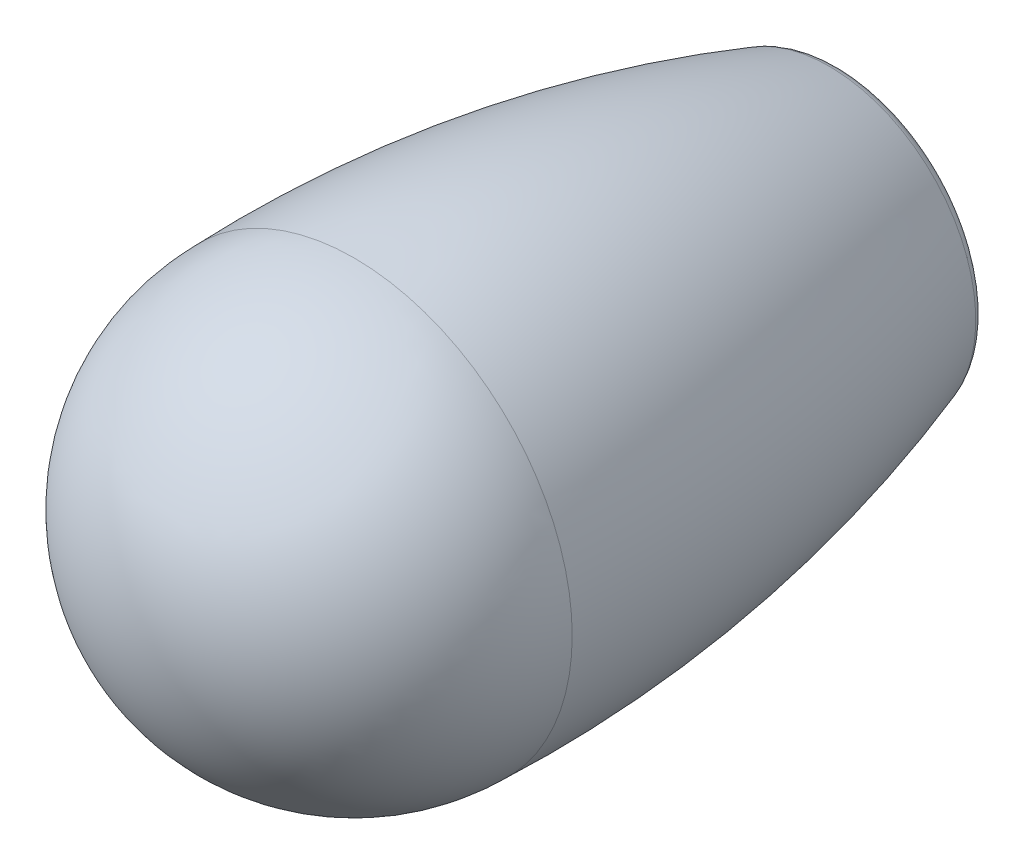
ISO-10303-21;
HEADER;
FILE_DESCRIPTION(('STEP AP214'),'2;1');
FILE_NAME('part.step','',(''),(''),'','','');
FILE_SCHEMA(('AUTOMOTIVE_DESIGN { 1 0 10303 214 1 1 1 1 }'));
ENDSEC;
DATA;
#1=APPLICATION_CONTEXT('core data for automotive mechanical design processes');
#2=APPLICATION_PROTOCOL_DEFINITION('international standard','automotive_design',2000,#1);
#3=PRODUCT_CONTEXT('',#1,'mechanical');
#4=PRODUCT('Part','Part','',(#3));
#5=PRODUCT_RELATED_PRODUCT_CATEGORY('part','',(#4));
#6=PRODUCT_DEFINITION_FORMATION('','',#4);
#7=PRODUCT_DEFINITION_CONTEXT('part definition',#1,'design');
#8=PRODUCT_DEFINITION('design','',#6,#7);
#9=PRODUCT_DEFINITION_SHAPE('','',#8);
#10=(LENGTH_UNIT() NAMED_UNIT(*) SI_UNIT(.MILLI.,.METRE.));
#11=(NAMED_UNIT(*) PLANE_ANGLE_UNIT() SI_UNIT($,.RADIAN.));
#12=(NAMED_UNIT(*) SI_UNIT($,.STERADIAN.) SOLID_ANGLE_UNIT());
#13=UNCERTAINTY_MEASURE_WITH_UNIT(LENGTH_MEASURE(1.E-05),#10,'distance_accuracy_value','');
#14=(GEOMETRIC_REPRESENTATION_CONTEXT(3) GLOBAL_UNCERTAINTY_ASSIGNED_CONTEXT((#13)) GLOBAL_UNIT_ASSIGNED_CONTEXT((#10,
#11,#12)) REPRESENTATION_CONTEXT('',''));
#15=CARTESIAN_POINT('',(0.,0.,0.));
#16=DIRECTION('',(0.,0.,1.));
#17=DIRECTION('',(1.,0.,0.));
#18=AXIS2_PLACEMENT_3D('',#15,#16,#17);
#19=CARTESIAN_POINT('',(0.,0.,1.));
#20=DIRECTION('',(0.,0.,-1.));
#21=DIRECTION('',(-1.,0.,0.));
#22=AXIS2_PLACEMENT_3D('',#19,#20,#21);
#23=TOROIDAL_SURFACE('',#22,7.78846659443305,1.);
#24=CARTESIAN_POINT('',(0.,0.,0.));
#25=DIRECTION('',(0.,0.,-1.));
#26=DIRECTION('',(-1.,0.,0.));
#27=AXIS2_PLACEMENT_3D('',#24,#25,#26);
#28=CIRCLE('',#27,7.78846659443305);
#29=CARTESIAN_POINT('',(-7.78846659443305,0.,0.));
#30=VERTEX_POINT('',#29);
#31=EDGE_CURVE('E8',#30,#30,#28,.T.);
#32=ORIENTED_EDGE('',*,*,#31,.F.);
#33=EDGE_LOOP('',(#32));
#34=FACE_BOUND('',#33,.T.);
#35=CARTESIAN_POINT('',(0.,0.,0.676469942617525));
#36=DIRECTION('',(0.,0.,-1.));
#37=DIRECTION('',(-1.,0.,0.));
#38=AXIS2_PLACEMENT_3D('',#35,#36,#37);
#39=CIRCLE('',#38,8.73468448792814);
#40=CARTESIAN_POINT('',(-8.73468448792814,0.,0.676469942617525));
#41=VERTEX_POINT('',#40);
#42=EDGE_CURVE('E37',#41,#41,#39,.T.);
#43=ORIENTED_EDGE('',*,*,#42,.T.);
#44=EDGE_LOOP('',(#43));
#45=FACE_BOUND('',#44,.T.);
#46=ADVANCED_FACE('F12',(#34,#45),#23,.T.);
#47=CARTESIAN_POINT('',(0.,7.788466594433,0.));
#48=DIRECTION('',(0.,0.,1.));
#49=DIRECTION('',(1.,0.,0.));
#50=AXIS2_PLACEMENT_3D('',#47,#48,#49);
#51=PLANE('',#50);
#52=CARTESIAN_POINT('',(0.,0.,0.));
#53=DIRECTION('',(0.,0.,-1.));
#54=DIRECTION('',(-1.,0.,0.));
#55=AXIS2_PLACEMENT_3D('',#52,#53,#54);
#56=CIRCLE('',#55,5.5);
#57=CARTESIAN_POINT('',(-5.5,0.,0.));
#58=VERTEX_POINT('',#57);
#59=EDGE_CURVE('E18',#58,#58,#56,.T.);
#60=ORIENTED_EDGE('',*,*,#59,.F.);
#61=EDGE_LOOP('',(#60));
#62=FACE_BOUND('',#61,.T.);
#63=ORIENTED_EDGE('',*,*,#31,.T.);
#64=EDGE_LOOP('',(#63));
#65=FACE_BOUND('',#64,.T.);
#66=ADVANCED_FACE('F61',(#62,#65),#51,.F.);
#67=CARTESIAN_POINT('',(0.,0.,-7.06669541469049));
#68=DIRECTION('',(0.,0.,-1.));
#69=DIRECTION('',(-1.,0.,0.));
#70=AXIS2_PLACEMENT_3D('',#67,#68,#69);
#71=CYLINDRICAL_SURFACE('',#70,5.5);
#72=CARTESIAN_POINT('',(0.,0.,11.));
#73=DIRECTION('',(0.,0.,-1.));
#74=DIRECTION('',(-1.,0.,0.));
#75=AXIS2_PLACEMENT_3D('',#72,#73,#74);
#76=CIRCLE('',#75,5.5);
#77=CARTESIAN_POINT('',(-5.5,0.,11.));
#78=VERTEX_POINT('',#77);
#79=EDGE_CURVE('E22',#78,#78,#76,.T.);
#80=ORIENTED_EDGE('',*,*,#79,.F.);
#81=EDGE_LOOP('',(#80));
#82=FACE_BOUND('',#81,.T.);
#83=ORIENTED_EDGE('',*,*,#59,.T.);
#84=EDGE_LOOP('',(#83));
#85=FACE_BOUND('',#84,.T.);
#86=ADVANCED_FACE('F67',(#82,#85),#71,.F.);
#87=CARTESIAN_POINT('',(0.,5.5,11.));
#88=DIRECTION('',(0.,0.,1.));
#89=DIRECTION('',(1.,0.,0.));
#90=AXIS2_PLACEMENT_3D('',#87,#88,#89);
#91=PLANE('',#90);
#92=CARTESIAN_POINT('',(0.,0.,11.));
#93=DIRECTION('',(0.,0.,-1.));
#94=DIRECTION('',(-1.,0.,0.));
#95=AXIS2_PLACEMENT_3D('',#92,#93,#94);
#96=CIRCLE('',#95,5.);
#97=CARTESIAN_POINT('',(-5.,0.,11.));
#98=VERTEX_POINT('',#97);
#99=EDGE_CURVE('E26',#98,#98,#96,.T.);
#100=ORIENTED_EDGE('',*,*,#99,.F.);
#101=EDGE_LOOP('',(#100));
#102=FACE_BOUND('',#101,.T.);
#103=ORIENTED_EDGE('',*,*,#79,.T.);
#104=EDGE_LOOP('',(#103));
#105=FACE_BOUND('',#104,.T.);
#106=ADVANCED_FACE('F73',(#102,#105),#91,.F.);
#107=CARTESIAN_POINT('',(0.,0.,-7.06669541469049));
#108=DIRECTION('',(0.,0.,-1.));
#109=DIRECTION('',(-1.,0.,0.));
#110=AXIS2_PLACEMENT_3D('',#107,#108,#109);
#111=CYLINDRICAL_SURFACE('',#110,5.);
#112=CARTESIAN_POINT('',(0.,0.,30.));
#113=DIRECTION('',(0.,0.,-1.));
#114=DIRECTION('',(-1.,0.,0.));
#115=AXIS2_PLACEMENT_3D('',#112,#113,#114);
#116=CIRCLE('',#115,5.);
#117=CARTESIAN_POINT('',(-5.,0.,30.));
#118=VERTEX_POINT('',#117);
#119=EDGE_CURVE('E31',#118,#118,#116,.T.);
#120=ORIENTED_EDGE('',*,*,#119,.F.);
#121=EDGE_LOOP('',(#120));
#122=FACE_BOUND('',#121,.T.);
#123=ORIENTED_EDGE('',*,*,#99,.T.);
#124=EDGE_LOOP('',(#123));
#125=FACE_BOUND('',#124,.T.);
#126=ADVANCED_FACE('F57',(#122,#125),#111,.F.);
#127=CARTESIAN_POINT('',(0.,5.,30.));
#128=DIRECTION('',(0.,0.,1.));
#129=DIRECTION('',(1.,0.,0.));
#130=AXIS2_PLACEMENT_3D('',#127,#128,#129);
#131=PLANE('',#130);
#132=ORIENTED_EDGE('',*,*,#119,.T.);
#133=EDGE_LOOP('',(#132));
#134=FACE_BOUND('',#133,.T.);
#135=ADVANCED_FACE('F50',(#134),#131,.F.);
#136=CARTESIAN_POINT('',(0.,0.,29.));
#137=DIRECTION('',(-1.,0.,0.));
#138=DIRECTION('',(0.,0.,1.));
#139=AXIS2_PLACEMENT_3D('',#136,#137,#138);
#140=SPHERICAL_SURFACE('',#139,13.);
#141=CARTESIAN_POINT('',(0.,0.,29.));
#142=DIRECTION('',(0.,0.,-1.));
#143=DIRECTION('',(-1.,0.,0.));
#144=AXIS2_PLACEMENT_3D('',#141,#142,#143);
#145=SPHERICAL_SURFACE('',#144,13.);
#146=CARTESIAN_POINT('',(0.,0.,29.));
#147=DIRECTION('',(0.,0.,-1.));
#148=DIRECTION('',(-1.,0.,0.));
#149=AXIS2_PLACEMENT_3D('',#146,#147,#148);
#150=CIRCLE('',#149,13.);
#151=CARTESIAN_POINT('',(-13.,0.,29.));
#152=VERTEX_POINT('',#151);
#153=EDGE_CURVE('E34',#152,#152,#150,.T.);
#154=ORIENTED_EDGE('',*,*,#153,.F.);
#155=EDGE_LOOP('',(#154));
#156=FACE_BOUND('',#155,.T.);
#157=ADVANCED_FACE('F45',(#156),#145,.T.);
#158=CARTESIAN_POINT('',(0.,0.,26.5588745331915));
#159=DIRECTION('',(0.,0.,-1.));
#160=DIRECTION('',(-1.,0.,0.));
#161=AXIS2_PLACEMENT_3D('',#158,#159,#160);
#162=DEGENERATE_TOROIDAL_SURFACE('',#161,66.9627469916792,80.,.F.);
#163=ORIENTED_EDGE('',*,*,#42,.F.);
#164=EDGE_LOOP('',(#163));
#165=FACE_BOUND('',#164,.T.);
#166=ORIENTED_EDGE('',*,*,#153,.T.);
#167=EDGE_LOOP('',(#166));
#168=FACE_BOUND('',#167,.T.);
#169=ADVANCED_FACE('F42',(#165,#168),#162,.F.);
#170=CLOSED_SHELL('',(#46,#66,#86,#106,#126,#135,#157,#169));
#171=MANIFOLD_SOLID_BREP('B1',#170);
#172=ADVANCED_BREP_SHAPE_REPRESENTATION('',(#18,#171),#14);
#173=SHAPE_DEFINITION_REPRESENTATION(#9,#172);
ENDSEC;
END-ISO-10303-21;
